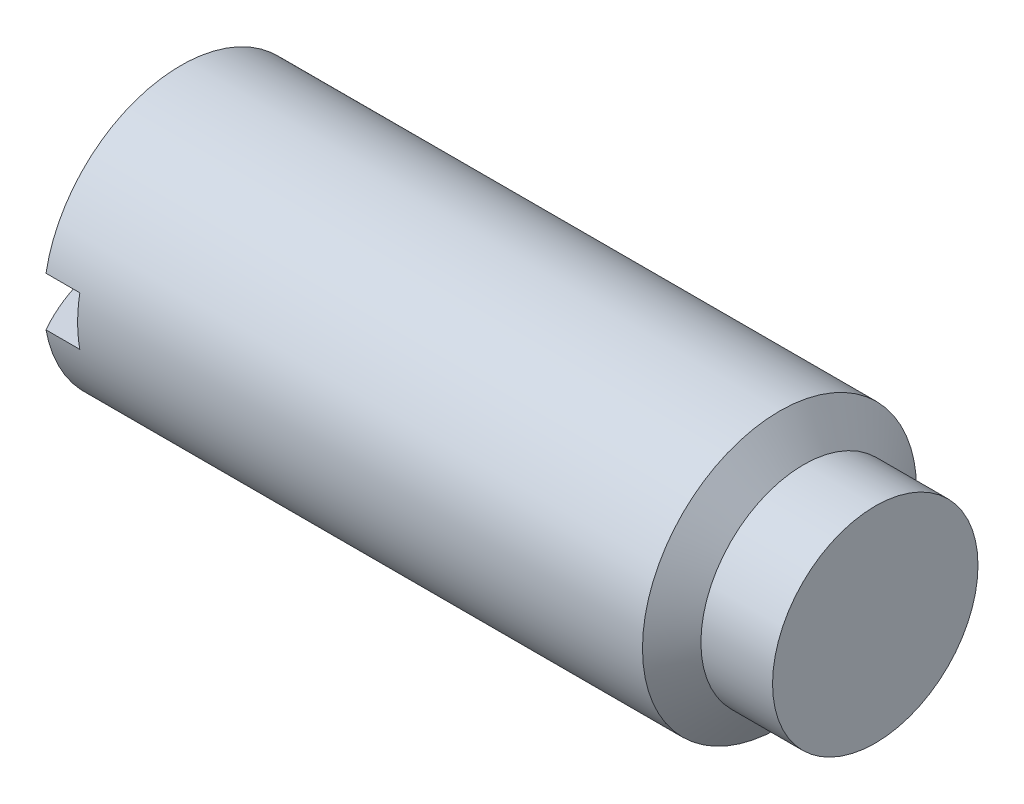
ISO-10303-21;
HEADER;
FILE_DESCRIPTION(('STEP AP214'),'2;1');
FILE_NAME('part.step','',(''),(''),'','','');
FILE_SCHEMA(('AUTOMOTIVE_DESIGN { 1 0 10303 214 1 1 1 1 }'));
ENDSEC;
DATA;
#1=APPLICATION_CONTEXT('core data for automotive mechanical design processes');
#2=APPLICATION_PROTOCOL_DEFINITION('international standard','automotive_design',2000,#1);
#3=PRODUCT_CONTEXT('',#1,'mechanical');
#4=PRODUCT('Part','Part','',(#3));
#5=PRODUCT_RELATED_PRODUCT_CATEGORY('part','',(#4));
#6=PRODUCT_DEFINITION_FORMATION('','',#4);
#7=PRODUCT_DEFINITION_CONTEXT('part definition',#1,'design');
#8=PRODUCT_DEFINITION('design','',#6,#7);
#9=PRODUCT_DEFINITION_SHAPE('','',#8);
#10=(LENGTH_UNIT() NAMED_UNIT(*) SI_UNIT(.MILLI.,.METRE.));
#11=(NAMED_UNIT(*) PLANE_ANGLE_UNIT() SI_UNIT($,.RADIAN.));
#12=(NAMED_UNIT(*) SI_UNIT($,.STERADIAN.) SOLID_ANGLE_UNIT());
#13=UNCERTAINTY_MEASURE_WITH_UNIT(LENGTH_MEASURE(1.E-05),#10,'distance_accuracy_value','');
#14=(GEOMETRIC_REPRESENTATION_CONTEXT(3) GLOBAL_UNCERTAINTY_ASSIGNED_CONTEXT((#13)) GLOBAL_UNIT_ASSIGNED_CONTEXT((#10,
#11,#12)) REPRESENTATION_CONTEXT('',''));
#15=CARTESIAN_POINT('',(0.,0.,0.));
#16=DIRECTION('',(0.,0.,1.));
#17=DIRECTION('',(1.,0.,0.));
#18=AXIS2_PLACEMENT_3D('',#15,#16,#17);
#19=CARTESIAN_POINT('',(19.05,0.,0.));
#20=DIRECTION('',(-1.,0.,0.));
#21=DIRECTION('',(0.,1.,0.));
#22=AXIS2_PLACEMENT_3D('',#19,#20,#21);
#23=SPHERICAL_SURFACE('',#22,19.05);
#24=CARTESIAN_POINT('',(19.05,1.7018,0.));
#25=DIRECTION('',(0.,-1.,0.));
#26=DIRECTION('',(0.,0.,-1.));
#27=AXIS2_PLACEMENT_3D('',#24,#25,#26);
#28=CIRCLE('',#27,18.9738340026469);
#29=CARTESIAN_POINT('',(2.55221605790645,1.7018,9.37173952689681));
#30=VERTEX_POINT('',#29);
#31=CARTESIAN_POINT('',(2.55221605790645,1.7018,-9.37173952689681));
#32=VERTEX_POINT('',#31);
#33=EDGE_CURVE('E103',#30,#32,#28,.T.);
#34=ORIENTED_EDGE('',*,*,#33,.F.);
#35=CARTESIAN_POINT('',(2.55221605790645,0.,0.));
#36=DIRECTION('',(-1.,0.,0.));
#37=DIRECTION('',(0.,0.,1.));
#38=AXIS2_PLACEMENT_3D('',#35,#36,#37);
#39=CIRCLE('',#38,9.525);
#40=EDGE_CURVE('E92',#30,#32,#39,.T.);
#41=ORIENTED_EDGE('',*,*,#40,.T.);
#42=EDGE_LOOP('',(#34,#41));
#43=FACE_BOUND('',#42,.T.);
#44=ADVANCED_FACE('F39',(#43),#23,.T.);
#45=CARTESIAN_POINT('',(19.05,-1.7018,0.));
#46=DIRECTION('',(0.,1.,0.));
#47=DIRECTION('',(0.,0.,1.));
#48=AXIS2_PLACEMENT_3D('',#45,#46,#47);
#49=CIRCLE('',#48,18.9738340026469);
#50=CARTESIAN_POINT('',(2.55221605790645,-1.7018,-9.37173952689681));
#51=VERTEX_POINT('',#50);
#52=CARTESIAN_POINT('',(2.55221605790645,-1.7018,9.37173952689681));
#53=VERTEX_POINT('',#52);
#54=EDGE_CURVE('E117',#51,#53,#49,.T.);
#55=ORIENTED_EDGE('',*,*,#54,.F.);
#56=EDGE_CURVE('E95',#51,#53,#39,.T.);
#57=ORIENTED_EDGE('',*,*,#56,.T.);
#58=EDGE_LOOP('',(#55,#57));
#59=FACE_BOUND('',#58,.T.);
#60=ADVANCED_FACE('F120',(#59),#23,.T.);
#61=CARTESIAN_POINT('',(-12.7,0.,0.));
#62=DIRECTION('',(-1.,0.,0.));
#63=DIRECTION('',(0.,0.,1.));
#64=AXIS2_PLACEMENT_3D('',#61,#62,#63);
#65=CYLINDRICAL_SURFACE('',#64,9.525);
#66=CARTESIAN_POINT('',(44.1497844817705,0.,0.));
#67=DIRECTION('',(-1.,0.,0.));
#68=DIRECTION('',(0.,0.,1.));
#69=AXIS2_PLACEMENT_3D('',#66,#67,#68);
#70=CIRCLE('',#69,9.525);
#71=CARTESIAN_POINT('',(44.1497844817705,0.,9.525));
#72=VERTEX_POINT('',#71);
#73=EDGE_CURVE('E93',#72,#72,#70,.T.);
#74=ORIENTED_EDGE('',*,*,#73,.T.);
#75=EDGE_LOOP('',(#74));
#76=FACE_BOUND('',#75,.T.);
#77=ORIENTED_EDGE('',*,*,#40,.F.);
#78=DIRECTION('',(-1.,0.,0.));
#79=VECTOR('',#78,1.);
#80=CARTESIAN_POINT('',(-12.7,1.7018,9.37173952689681));
#81=LINE('',#80,#79);
#82=CARTESIAN_POINT('',(4.9022,1.7018,9.37173952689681));
#83=VERTEX_POINT('',#82);
#84=EDGE_CURVE('E11',#30,#83,#81,.F.);
#85=ORIENTED_EDGE('',*,*,#84,.T.);
#86=CARTESIAN_POINT('',(4.9022,0.,0.));
#87=DIRECTION('',(1.,0.,0.));
#88=DIRECTION('',(0.,0.,-1.));
#89=AXIS2_PLACEMENT_3D('',#86,#87,#88);
#90=CIRCLE('',#89,9.525);
#91=CARTESIAN_POINT('',(4.9022,-1.7018,9.37173952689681));
#92=VERTEX_POINT('',#91);
#93=EDGE_CURVE('E75',#92,#83,#90,.F.);
#94=ORIENTED_EDGE('',*,*,#93,.F.);
#95=DIRECTION('',(-1.,0.,0.));
#96=VECTOR('',#95,1.);
#97=CARTESIAN_POINT('',(-12.7,-1.7018,9.37173952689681));
#98=LINE('',#97,#96);
#99=EDGE_CURVE('E46',#92,#53,#98,.T.);
#100=ORIENTED_EDGE('',*,*,#99,.T.);
#101=ORIENTED_EDGE('',*,*,#56,.F.);
#102=DIRECTION('',(-1.,0.,0.));
#103=VECTOR('',#102,1.);
#104=CARTESIAN_POINT('',(-12.7,-1.7018,-9.37173952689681));
#105=LINE('',#104,#103);
#106=CARTESIAN_POINT('',(4.9022,-1.7018,-9.37173952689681));
#107=VERTEX_POINT('',#106);
#108=EDGE_CURVE('E109',#51,#107,#105,.F.);
#109=ORIENTED_EDGE('',*,*,#108,.T.);
#110=CARTESIAN_POINT('',(4.9022,1.7018,-9.37173952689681));
#111=VERTEX_POINT('',#110);
#112=EDGE_CURVE('E83',#111,#107,#90,.F.);
#113=ORIENTED_EDGE('',*,*,#112,.F.);
#114=DIRECTION('',(-1.,0.,0.));
#115=VECTOR('',#114,1.);
#116=CARTESIAN_POINT('',(-12.7,1.7018,-9.37173952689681));
#117=LINE('',#116,#115);
#118=EDGE_CURVE('E81',#111,#32,#117,.T.);
#119=ORIENTED_EDGE('',*,*,#118,.T.);
#120=EDGE_LOOP('',(#77,#85,#94,#100,#101,#109,#113,#119));
#121=FACE_BOUND('',#120,.T.);
#122=ADVANCED_FACE('F89',(#76,#121),#65,.T.);
#123=CARTESIAN_POINT('',(50.8,7.1374,0.));
#124=DIRECTION('',(1.,0.,0.));
#125=DIRECTION('',(0.,0.,-1.));
#126=AXIS2_PLACEMENT_3D('',#123,#124,#125);
#127=PLANE('',#126);
#128=CARTESIAN_POINT('',(50.8,0.,0.));
#129=DIRECTION('',(-1.,0.,0.));
#130=DIRECTION('',(0.,0.,1.));
#131=AXIS2_PLACEMENT_3D('',#128,#129,#130);
#132=CIRCLE('',#131,7.1374);
#133=CARTESIAN_POINT('',(50.8,0.,7.1374));
#134=VERTEX_POINT('',#133);
#135=EDGE_CURVE('E110',#134,#134,#132,.T.);
#136=ORIENTED_EDGE('',*,*,#135,.F.);
#137=EDGE_LOOP('',(#136));
#138=FACE_BOUND('',#137,.T.);
#139=ADVANCED_FACE('F139',(#138),#127,.T.);
#140=CARTESIAN_POINT('',(-12.7,0.,0.));
#141=DIRECTION('',(-1.,0.,0.));
#142=DIRECTION('',(0.,0.,1.));
#143=AXIS2_PLACEMENT_3D('',#140,#141,#142);
#144=CYLINDRICAL_SURFACE('',#143,7.1374);
#145=ORIENTED_EDGE('',*,*,#135,.T.);
#146=EDGE_LOOP('',(#145));
#147=FACE_BOUND('',#146,.T.);
#148=CARTESIAN_POINT('',(45.8216,0.,0.));
#149=DIRECTION('',(-1.,0.,0.));
#150=DIRECTION('',(0.,0.,1.));
#151=AXIS2_PLACEMENT_3D('',#148,#149,#150);
#152=CIRCLE('',#151,7.1374);
#153=CARTESIAN_POINT('',(45.8216,0.,7.1374));
#154=VERTEX_POINT('',#153);
#155=EDGE_CURVE('E96',#154,#154,#152,.T.);
#156=ORIENTED_EDGE('',*,*,#155,.F.);
#157=EDGE_LOOP('',(#156));
#158=FACE_BOUND('',#157,.T.);
#159=ADVANCED_FACE('F144',(#147,#158),#144,.T.);
#160=CARTESIAN_POINT('',(45.8216,0.,0.));
#161=DIRECTION('',(-1.,0.,0.));
#162=DIRECTION('',(0.,0.,1.));
#163=AXIS2_PLACEMENT_3D('',#160,#161,#162);
#164=CONICAL_SURFACE('',#163,7.1374,0.959931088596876);
#165=ORIENTED_EDGE('',*,*,#73,.F.);
#166=EDGE_LOOP('',(#165));
#167=FACE_BOUND('',#166,.T.);
#168=ORIENTED_EDGE('',*,*,#155,.T.);
#169=EDGE_LOOP('',(#168));
#170=FACE_BOUND('',#169,.T.);
#171=ADVANCED_FACE('F130',(#167,#170),#164,.T.);
#172=CARTESIAN_POINT('',(4.9022,1.7018,-9.52499999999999));
#173=DIRECTION('',(0.,-1.,0.));
#174=DIRECTION('',(0.,0.,-1.));
#175=AXIS2_PLACEMENT_3D('',#172,#173,#174);
#176=PLANE('',#175);
#177=ORIENTED_EDGE('',*,*,#33,.T.);
#178=ORIENTED_EDGE('',*,*,#118,.F.);
#179=DIRECTION('',(0.,0.,1.));
#180=VECTOR('',#179,1.);
#181=CARTESIAN_POINT('',(4.9022,1.7018,-9.52499999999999));
#182=LINE('',#181,#180);
#183=EDGE_CURVE('E52',#111,#83,#182,.T.);
#184=ORIENTED_EDGE('',*,*,#183,.T.);
#185=ORIENTED_EDGE('',*,*,#84,.F.);
#186=EDGE_LOOP('',(#177,#178,#184,#185));
#187=FACE_BOUND('',#186,.T.);
#188=ADVANCED_FACE('F82',(#187),#176,.T.);
#189=CARTESIAN_POINT('',(4.9022,-1.7018,-9.52499999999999));
#190=DIRECTION('',(0.,1.,0.));
#191=DIRECTION('',(0.,0.,1.));
#192=AXIS2_PLACEMENT_3D('',#189,#190,#191);
#193=PLANE('',#192);
#194=ORIENTED_EDGE('',*,*,#54,.T.);
#195=ORIENTED_EDGE('',*,*,#99,.F.);
#196=DIRECTION('',(0.,0.,-1.));
#197=VECTOR('',#196,1.);
#198=CARTESIAN_POINT('',(4.9022,-1.7018,-9.52499999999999));
#199=LINE('',#198,#197);
#200=EDGE_CURVE('E76',#92,#107,#199,.T.);
#201=ORIENTED_EDGE('',*,*,#200,.T.);
#202=ORIENTED_EDGE('',*,*,#108,.F.);
#203=EDGE_LOOP('',(#194,#195,#201,#202));
#204=FACE_BOUND('',#203,.T.);
#205=ADVANCED_FACE('F119',(#204),#193,.T.);
#206=CARTESIAN_POINT('',(4.9022,1.7018,-9.52499999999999));
#207=DIRECTION('',(1.,0.,0.));
#208=DIRECTION('',(0.,0.,-1.));
#209=AXIS2_PLACEMENT_3D('',#206,#207,#208);
#210=PLANE('',#209);
#211=ORIENTED_EDGE('',*,*,#200,.F.);
#212=ORIENTED_EDGE('',*,*,#93,.T.);
#213=ORIENTED_EDGE('',*,*,#183,.F.);
#214=ORIENTED_EDGE('',*,*,#112,.T.);
#215=EDGE_LOOP('',(#211,#212,#213,#214));
#216=FACE_BOUND('',#215,.T.);
#217=ADVANCED_FACE('F77',(#216),#210,.F.);
#218=CLOSED_SHELL('',(#44,#60,#122,#139,#159,#171,#188,#205,#217));
#219=MANIFOLD_SOLID_BREP('B2',#218);
#220=ADVANCED_BREP_SHAPE_REPRESENTATION('',(#18,#219),#14);
#221=SHAPE_DEFINITION_REPRESENTATION(#9,#220);
ENDSEC;
END-ISO-10303-21;
